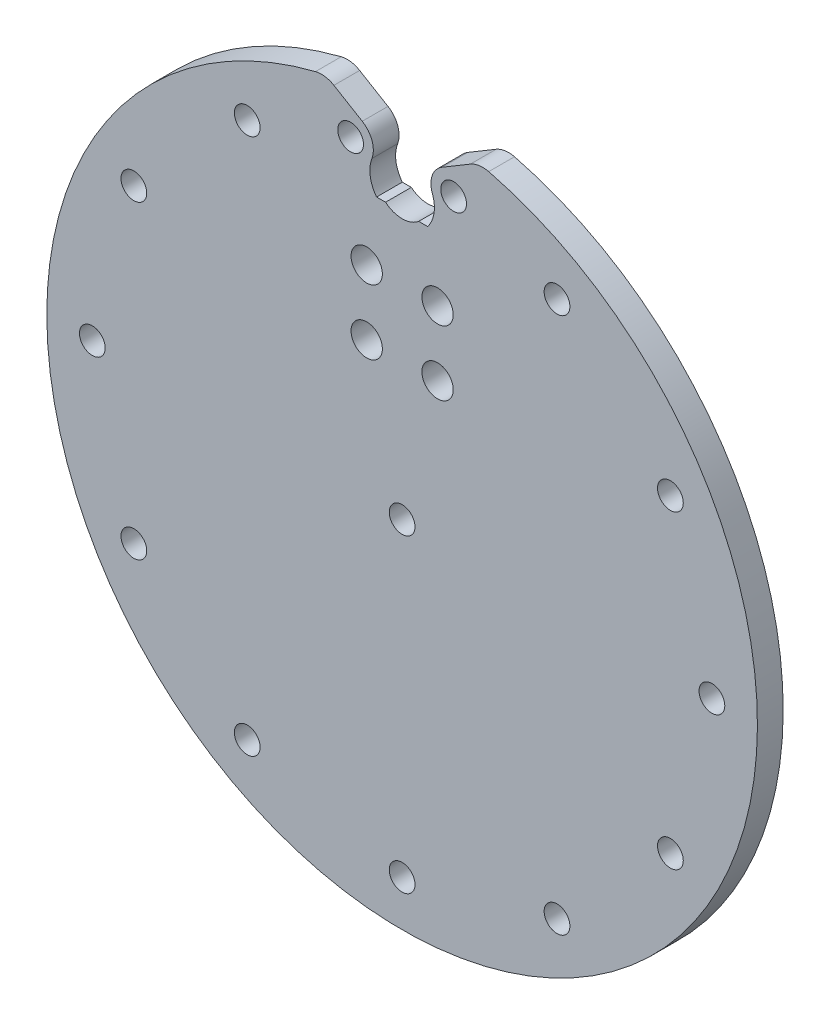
ISO-10303-21;
HEADER;
FILE_DESCRIPTION(('STEP AP214'),'2;1');
FILE_NAME('part.step','',(''),(''),'','','');
FILE_SCHEMA(('AUTOMOTIVE_DESIGN { 1 0 10303 214 1 1 1 1 }'));
ENDSEC;
DATA;
#1=APPLICATION_CONTEXT('core data for automotive mechanical design processes');
#2=APPLICATION_PROTOCOL_DEFINITION('international standard','automotive_design',2000,#1);
#3=PRODUCT_CONTEXT('',#1,'mechanical');
#4=PRODUCT('Part','Part','',(#3));
#5=PRODUCT_RELATED_PRODUCT_CATEGORY('part','',(#4));
#6=PRODUCT_DEFINITION_FORMATION('','',#4);
#7=PRODUCT_DEFINITION_CONTEXT('part definition',#1,'design');
#8=PRODUCT_DEFINITION('design','',#6,#7);
#9=PRODUCT_DEFINITION_SHAPE('','',#8);
#10=(LENGTH_UNIT() NAMED_UNIT(*) SI_UNIT(.MILLI.,.METRE.));
#11=(NAMED_UNIT(*) PLANE_ANGLE_UNIT() SI_UNIT($,.RADIAN.));
#12=(NAMED_UNIT(*) SI_UNIT($,.STERADIAN.) SOLID_ANGLE_UNIT());
#13=UNCERTAINTY_MEASURE_WITH_UNIT(LENGTH_MEASURE(1.E-05),#10,'distance_accuracy_value','');
#14=(GEOMETRIC_REPRESENTATION_CONTEXT(3) GLOBAL_UNCERTAINTY_ASSIGNED_CONTEXT((#13)) GLOBAL_UNIT_ASSIGNED_CONTEXT((#10,
#11,#12)) REPRESENTATION_CONTEXT('',''));
#15=CARTESIAN_POINT('',(0.,0.,0.));
#16=DIRECTION('',(0.,0.,1.));
#17=DIRECTION('',(1.,0.,0.));
#18=AXIS2_PLACEMENT_3D('',#15,#16,#17);
#19=CARTESIAN_POINT('',(0.,0.,3.175));
#20=DIRECTION('',(0.,0.,1.));
#21=DIRECTION('',(1.,0.,0.));
#22=AXIS2_PLACEMENT_3D('',#19,#20,#21);
#23=PLANE('',#22);
#24=CARTESIAN_POINT('',(6.35,37.6685213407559,3.175));
#25=DIRECTION('',(0.,0.,1.));
#26=DIRECTION('',(1.,0.,0.));
#27=AXIS2_PLACEMENT_3D('',#24,#25,#26);
#28=CIRCLE('',#27,1.5875000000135);
#29=CARTESIAN_POINT('',(7.9375000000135,37.6685213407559,3.175));
#30=VERTEX_POINT('',#29);
#31=EDGE_CURVE('E564',#30,#30,#28,.T.);
#32=ORIENTED_EDGE('',*,*,#31,.F.);
#33=EDGE_LOOP('',(#32));
#34=FACE_BOUND('',#33,.T.);
#35=CARTESIAN_POINT('',(4.36880000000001,25.,3.175));
#36=DIRECTION('',(0.,0.,1.));
#37=DIRECTION('',(1.,0.,0.));
#38=AXIS2_PLACEMENT_3D('',#35,#36,#37);
#39=CIRCLE('',#38,1.9304);
#40=CARTESIAN_POINT('',(6.29920000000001,25.,3.175));
#41=VERTEX_POINT('',#40);
#42=EDGE_CURVE('E576',#41,#41,#39,.T.);
#43=ORIENTED_EDGE('',*,*,#42,.F.);
#44=EDGE_LOOP('',(#43));
#45=FACE_BOUND('',#44,.T.);
#46=CARTESIAN_POINT('',(-4.36880000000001,17.,3.175));
#47=DIRECTION('',(0.,0.,1.));
#48=DIRECTION('',(1.,0.,0.));
#49=AXIS2_PLACEMENT_3D('',#46,#47,#48);
#50=CIRCLE('',#49,1.9304);
#51=CARTESIAN_POINT('',(-2.43840000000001,17.,3.175));
#52=VERTEX_POINT('',#51);
#53=EDGE_CURVE('E588',#52,#52,#50,.T.);
#54=ORIENTED_EDGE('',*,*,#53,.F.);
#55=EDGE_LOOP('',(#54));
#56=FACE_BOUND('',#55,.T.);
#57=CARTESIAN_POINT('',(19.0999999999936,33.0821704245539,3.175));
#58=DIRECTION('',(0.,0.,1.));
#59=DIRECTION('',(1.,0.,0.));
#60=AXIS2_PLACEMENT_3D('',#57,#58,#59);
#61=CIRCLE('',#60,1.58750000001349);
#62=CARTESIAN_POINT('',(20.6875000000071,33.0821704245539,3.175));
#63=VERTEX_POINT('',#62);
#64=EDGE_CURVE('E600',#63,#63,#61,.T.);
#65=ORIENTED_EDGE('',*,*,#64,.F.);
#66=EDGE_LOOP('',(#65));
#67=FACE_BOUND('',#66,.T.);
#68=CARTESIAN_POINT('',(-19.0999999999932,33.0821704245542,3.175));
#69=DIRECTION('',(0.,0.,1.));
#70=DIRECTION('',(1.,0.,0.));
#71=AXIS2_PLACEMENT_3D('',#68,#69,#70);
#72=CIRCLE('',#71,1.5875000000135);
#73=CARTESIAN_POINT('',(-17.5124999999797,33.0821704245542,3.175));
#74=VERTEX_POINT('',#73);
#75=EDGE_CURVE('E612',#74,#74,#72,.T.);
#76=ORIENTED_EDGE('',*,*,#75,.F.);
#77=EDGE_LOOP('',(#76));
#78=FACE_BOUND('',#77,.T.);
#79=CARTESIAN_POINT('',(-38.1999999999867,1.33374587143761E-13,3.175));
#80=DIRECTION('',(0.,0.,1.));
#81=DIRECTION('',(1.,0.,0.));
#82=AXIS2_PLACEMENT_3D('',#79,#80,#81);
#83=CIRCLE('',#82,1.58750000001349);
#84=CARTESIAN_POINT('',(-36.6124999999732,1.33374587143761E-13,3.175));
#85=VERTEX_POINT('',#84);
#86=EDGE_CURVE('E624',#85,#85,#83,.T.);
#87=ORIENTED_EDGE('',*,*,#86,.F.);
#88=EDGE_LOOP('',(#87));
#89=FACE_BOUND('',#88,.T.);
#90=CARTESIAN_POINT('',(33.0821704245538,-19.0999999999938,3.175));
#91=DIRECTION('',(0.,0.,1.));
#92=DIRECTION('',(1.,0.,0.));
#93=AXIS2_PLACEMENT_3D('',#90,#91,#92);
#94=CIRCLE('',#93,1.58750000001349);
#95=CARTESIAN_POINT('',(34.6696704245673,-19.0999999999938,3.175));
#96=VERTEX_POINT('',#95);
#97=EDGE_CURVE('E636',#96,#96,#94,.T.);
#98=ORIENTED_EDGE('',*,*,#97,.F.);
#99=EDGE_LOOP('',(#98));
#100=FACE_BOUND('',#99,.T.);
#101=CARTESIAN_POINT('',(0.,-38.1999999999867,3.175));
#102=DIRECTION('',(0.,0.,1.));
#103=DIRECTION('',(1.,0.,0.));
#104=AXIS2_PLACEMENT_3D('',#101,#102,#103);
#105=CIRCLE('',#104,1.58750000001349);
#106=CARTESIAN_POINT('',(1.58750000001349,-38.1999999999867,3.175));
#107=VERTEX_POINT('',#106);
#108=EDGE_CURVE('E648',#107,#107,#105,.T.);
#109=ORIENTED_EDGE('',*,*,#108,.F.);
#110=EDGE_LOOP('',(#109));
#111=FACE_BOUND('',#110,.T.);
#112=CARTESIAN_POINT('',(-33.0821704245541,-19.0999999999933,3.175));
#113=DIRECTION('',(0.,0.,1.));
#114=DIRECTION('',(1.,0.,0.));
#115=AXIS2_PLACEMENT_3D('',#112,#113,#114);
#116=CIRCLE('',#115,1.58750000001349);
#117=CARTESIAN_POINT('',(-31.4946704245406,-19.0999999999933,3.175));
#118=VERTEX_POINT('',#117);
#119=EDGE_CURVE('E172',#118,#118,#116,.T.);
#120=ORIENTED_EDGE('',*,*,#119,.F.);
#121=EDGE_LOOP('',(#120));
#122=FACE_BOUND('',#121,.T.);
#123=CARTESIAN_POINT('',(0.,0.,3.175));
#124=DIRECTION('',(0.,0.,1.));
#125=DIRECTION('',(1.,0.,0.));
#126=AXIS2_PLACEMENT_3D('',#123,#124,#125);
#127=CIRCLE('',#126,43.815);
#128=CARTESIAN_POINT('',(-10.6819342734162,42.4929465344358,3.175));
#129=VERTEX_POINT('',#128);
#130=CARTESIAN_POINT('',(10.6819342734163,42.4929465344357,3.175));
#131=VERTEX_POINT('',#130);
#132=EDGE_CURVE('E137',#129,#131,#127,.T.);
#133=ORIENTED_EDGE('',*,*,#132,.T.);
#134=CARTESIAN_POINT('',(9.95054541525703,39.5834671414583,3.175));
#135=DIRECTION('',(0.,0.,1.));
#136=DIRECTION('',(1.,0.,0.));
#137=AXIS2_PLACEMENT_3D('',#134,#135,#136);
#138=CIRCLE('',#137,3.);
#139=CARTESIAN_POINT('',(8.41363997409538,42.1598835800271,3.175));
#140=VERTEX_POINT('',#139);
#141=EDGE_CURVE('E45',#131,#140,#138,.T.);
#142=ORIENTED_EDGE('',*,*,#141,.T.);
#143=DIRECTION('',(-0.858805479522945,-0.512301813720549,0.));
#144=VECTOR('',#143,1.);
#145=CARTESIAN_POINT('',(4.91555492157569,40.0731766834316,3.175));
#146=LINE('',#145,#144);
#147=CARTESIAN_POINT('',(4.91555492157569,40.0731766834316,3.175));
#148=VERTEX_POINT('',#147);
#149=EDGE_CURVE('E127',#140,#148,#146,.T.);
#150=ORIENTED_EDGE('',*,*,#149,.T.);
#151=CARTESIAN_POINT('',(6.35,37.6685213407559,3.175));
#152=DIRECTION('',(0.,0.,1.));
#153=DIRECTION('',(1.,0.,0.));
#154=AXIS2_PLACEMENT_3D('',#151,#152,#153);
#155=CIRCLE('',#154,2.80000000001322);
#156=CARTESIAN_POINT('',(3.72758112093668,36.6872368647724,3.175));
#157=VERTEX_POINT('',#156);
#158=EDGE_CURVE('E131',#148,#157,#155,.T.);
#159=ORIENTED_EDGE('',*,*,#158,.T.);
#160=CARTESIAN_POINT('',(0.,35.2924110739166,3.175));
#161=DIRECTION('',(0.,0.,-1.));
#162=DIRECTION('',(1.,0.,0.));
#163=AXIS2_PLACEMENT_3D('',#160,#161,#162);
#164=CIRCLE('',#163,3.98);
#165=CARTESIAN_POINT('',(3.15206281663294,32.8624110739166,3.175));
#166=VERTEX_POINT('',#165);
#167=EDGE_CURVE('E152',#157,#166,#164,.T.);
#168=ORIENTED_EDGE('',*,*,#167,.T.);
#169=DIRECTION('',(-1.,0.,0.));
#170=VECTOR('',#169,1.);
#171=CARTESIAN_POINT('',(2.04345907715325,32.8624110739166,3.175));
#172=LINE('',#171,#170);
#173=CARTESIAN_POINT('',(2.04345907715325,32.8624110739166,3.175));
#174=VERTEX_POINT('',#173);
#175=EDGE_CURVE('E154',#166,#174,#172,.T.);
#176=ORIENTED_EDGE('',*,*,#175,.T.);
#177=CARTESIAN_POINT('',(0.,35.2924110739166,3.175));
#178=DIRECTION('',(0.,0.,-1.));
#179=DIRECTION('',(1.,0.,0.));
#180=AXIS2_PLACEMENT_3D('',#177,#178,#179);
#181=CIRCLE('',#180,3.175);
#182=CARTESIAN_POINT('',(-2.04345907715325,32.8624110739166,3.175));
#183=VERTEX_POINT('',#182);
#184=EDGE_CURVE('E159',#174,#183,#181,.T.);
#185=ORIENTED_EDGE('',*,*,#184,.T.);
#186=DIRECTION('',(-1.,0.,0.));
#187=VECTOR('',#186,1.);
#188=CARTESIAN_POINT('',(-2.04345907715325,32.8624110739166,3.175));
#189=LINE('',#188,#187);
#190=CARTESIAN_POINT('',(-3.15206281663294,32.8624110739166,3.175));
#191=VERTEX_POINT('',#190);
#192=EDGE_CURVE('E161',#183,#191,#189,.T.);
#193=ORIENTED_EDGE('',*,*,#192,.T.);
#194=CARTESIAN_POINT('',(0.,35.2924110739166,3.175));
#195=DIRECTION('',(0.,0.,-1.));
#196=DIRECTION('',(1.,0.,0.));
#197=AXIS2_PLACEMENT_3D('',#194,#195,#196);
#198=CIRCLE('',#197,3.98);
#199=CARTESIAN_POINT('',(-3.72758112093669,36.6872368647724,3.175));
#200=VERTEX_POINT('',#199);
#201=EDGE_CURVE('E163',#191,#200,#198,.T.);
#202=ORIENTED_EDGE('',*,*,#201,.T.);
#203=CARTESIAN_POINT('',(-6.35000000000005,37.6685213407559,3.175));
#204=DIRECTION('',(0.,0.,1.));
#205=DIRECTION('',(1.,0.,0.));
#206=AXIS2_PLACEMENT_3D('',#203,#204,#205);
#207=CIRCLE('',#206,2.80000000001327);
#208=CARTESIAN_POINT('',(-4.91555492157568,40.0731766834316,3.175));
#209=VERTEX_POINT('',#208);
#210=EDGE_CURVE('E165',#200,#209,#207,.T.);
#211=ORIENTED_EDGE('',*,*,#210,.T.);
#212=DIRECTION('',(-0.858805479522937,0.512301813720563,0.));
#213=VECTOR('',#212,1.);
#214=CARTESIAN_POINT('',(-4.91555492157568,40.0731766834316,3.175));
#215=LINE('',#214,#213);
#216=CARTESIAN_POINT('',(-8.41363997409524,42.1598835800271,3.175));
#217=VERTEX_POINT('',#216);
#218=EDGE_CURVE('E167',#209,#217,#215,.T.);
#219=ORIENTED_EDGE('',*,*,#218,.T.);
#220=CARTESIAN_POINT('',(-9.95054541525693,39.5834671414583,3.175));
#221=DIRECTION('',(0.,0.,1.));
#222=DIRECTION('',(1.,0.,0.));
#223=AXIS2_PLACEMENT_3D('',#220,#221,#222);
#224=CIRCLE('',#223,3.);
#225=EDGE_CURVE('E217',#217,#129,#224,.T.);
#226=ORIENTED_EDGE('',*,*,#225,.T.);
#227=EDGE_LOOP('',(#133,#142,#150,#159,#168,#176,#185,#193,#202,#211,#219,#226));
#228=FACE_BOUND('',#227,.T.);
#229=CARTESIAN_POINT('',(-19.0999999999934,-33.082170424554,3.175));
#230=DIRECTION('',(0.,0.,1.));
#231=DIRECTION('',(1.,0.,0.));
#232=AXIS2_PLACEMENT_3D('',#229,#230,#231);
#233=CIRCLE('',#232,1.58750000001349);
#234=CARTESIAN_POINT('',(-17.5124999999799,-33.082170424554,3.175));
#235=VERTEX_POINT('',#234);
#236=EDGE_CURVE('E654',#235,#235,#233,.T.);
#237=ORIENTED_EDGE('',*,*,#236,.F.);
#238=EDGE_LOOP('',(#237));
#239=FACE_BOUND('',#238,.T.);
#240=CARTESIAN_POINT('',(19.0999999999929,-33.0821704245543,3.175));
#241=DIRECTION('',(0.,0.,1.));
#242=DIRECTION('',(1.,0.,0.));
#243=AXIS2_PLACEMENT_3D('',#240,#241,#242);
#244=CIRCLE('',#243,1.58750000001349);
#245=CARTESIAN_POINT('',(20.6875000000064,-33.0821704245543,3.175));
#246=VERTEX_POINT('',#245);
#247=EDGE_CURVE('E642',#246,#246,#244,.T.);
#248=ORIENTED_EDGE('',*,*,#247,.F.);
#249=EDGE_LOOP('',(#248));
#250=FACE_BOUND('',#249,.T.);
#251=CARTESIAN_POINT('',(38.1999999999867,-4.00123761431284E-13,3.175));
#252=DIRECTION('',(0.,0.,1.));
#253=DIRECTION('',(1.,0.,0.));
#254=AXIS2_PLACEMENT_3D('',#251,#252,#253);
#255=CIRCLE('',#254,1.58750000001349);
#256=CARTESIAN_POINT('',(39.7875000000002,-4.00123761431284E-13,3.175));
#257=VERTEX_POINT('',#256);
#258=EDGE_CURVE('E630',#257,#257,#255,.T.);
#259=ORIENTED_EDGE('',*,*,#258,.F.);
#260=EDGE_LOOP('',(#259));
#261=FACE_BOUND('',#260,.T.);
#262=CARTESIAN_POINT('',(-33.082170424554,19.0999999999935,3.175));
#263=DIRECTION('',(0.,0.,1.));
#264=DIRECTION('',(1.,0.,0.));
#265=AXIS2_PLACEMENT_3D('',#262,#263,#264);
#266=CIRCLE('',#265,1.58750000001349);
#267=CARTESIAN_POINT('',(-31.4946704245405,19.0999999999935,3.175));
#268=VERTEX_POINT('',#267);
#269=EDGE_CURVE('E618',#268,#268,#266,.T.);
#270=ORIENTED_EDGE('',*,*,#269,.F.);
#271=EDGE_LOOP('',(#270));
#272=FACE_BOUND('',#271,.T.);
#273=CARTESIAN_POINT('',(33.0821704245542,19.0999999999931,3.175));
#274=DIRECTION('',(0.,0.,1.));
#275=DIRECTION('',(1.,0.,0.));
#276=AXIS2_PLACEMENT_3D('',#273,#274,#275);
#277=CIRCLE('',#276,1.5875000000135);
#278=CARTESIAN_POINT('',(34.6696704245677,19.0999999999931,3.175));
#279=VERTEX_POINT('',#278);
#280=EDGE_CURVE('E606',#279,#279,#277,.T.);
#281=ORIENTED_EDGE('',*,*,#280,.F.);
#282=EDGE_LOOP('',(#281));
#283=FACE_BOUND('',#282,.T.);
#284=CARTESIAN_POINT('',(-6.35000000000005,37.6685213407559,3.175));
#285=DIRECTION('',(0.,0.,1.));
#286=DIRECTION('',(1.,0.,0.));
#287=AXIS2_PLACEMENT_3D('',#284,#285,#286);
#288=CIRCLE('',#287,1.58750000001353);
#289=CARTESIAN_POINT('',(-4.76249999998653,37.6685213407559,3.175));
#290=VERTEX_POINT('',#289);
#291=EDGE_CURVE('E594',#290,#290,#288,.T.);
#292=ORIENTED_EDGE('',*,*,#291,.F.);
#293=EDGE_LOOP('',(#292));
#294=FACE_BOUND('',#293,.T.);
#295=CARTESIAN_POINT('',(-4.36880000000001,25.,3.175));
#296=DIRECTION('',(0.,0.,1.));
#297=DIRECTION('',(1.,0.,0.));
#298=AXIS2_PLACEMENT_3D('',#295,#296,#297);
#299=CIRCLE('',#298,1.9304);
#300=CARTESIAN_POINT('',(-2.43840000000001,25.,3.175));
#301=VERTEX_POINT('',#300);
#302=EDGE_CURVE('E582',#301,#301,#299,.T.);
#303=ORIENTED_EDGE('',*,*,#302,.F.);
#304=EDGE_LOOP('',(#303));
#305=FACE_BOUND('',#304,.T.);
#306=CARTESIAN_POINT('',(4.36880000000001,17.,3.175));
#307=DIRECTION('',(0.,0.,1.));
#308=DIRECTION('',(1.,0.,0.));
#309=AXIS2_PLACEMENT_3D('',#306,#307,#308);
#310=CIRCLE('',#309,1.9304);
#311=CARTESIAN_POINT('',(6.29920000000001,17.,3.175));
#312=VERTEX_POINT('',#311);
#313=EDGE_CURVE('E570',#312,#312,#310,.T.);
#314=ORIENTED_EDGE('',*,*,#313,.F.);
#315=EDGE_LOOP('',(#314));
#316=FACE_BOUND('',#315,.T.);
#317=CARTESIAN_POINT('',(0.,0.,3.175));
#318=DIRECTION('',(0.,0.,1.));
#319=DIRECTION('',(1.,0.,0.));
#320=AXIS2_PLACEMENT_3D('',#317,#318,#319);
#321=CIRCLE('',#320,1.5875);
#322=CARTESIAN_POINT('',(1.5875,0.,3.175));
#323=VERTEX_POINT('',#322);
#324=EDGE_CURVE('E555',#323,#323,#321,.T.);
#325=ORIENTED_EDGE('',*,*,#324,.F.);
#326=EDGE_LOOP('',(#325));
#327=FACE_BOUND('',#326,.T.);
#328=ADVANCED_FACE('F37',(#34,#45,#56,#67,#78,#89,#100,#111,#122,#228,#239,#250,#261,#272,#283,
#294,#305,#316,#327),#23,.T.);
#329=CARTESIAN_POINT('',(0.,0.,0.));
#330=DIRECTION('',(0.,0.,1.));
#331=DIRECTION('',(1.,0.,0.));
#332=AXIS2_PLACEMENT_3D('',#329,#330,#331);
#333=PLANE('',#332);
#334=DIRECTION('',(-0.858805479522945,-0.512301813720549,0.));
#335=VECTOR('',#334,1.);
#336=CARTESIAN_POINT('',(4.91555492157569,40.0731766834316,0.));
#337=LINE('',#336,#335);
#338=CARTESIAN_POINT('',(8.41363997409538,42.1598835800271,0.));
#339=VERTEX_POINT('',#338);
#340=CARTESIAN_POINT('',(4.91555492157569,40.0731766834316,0.));
#341=VERTEX_POINT('',#340);
#342=EDGE_CURVE('E143',#339,#341,#337,.T.);
#343=ORIENTED_EDGE('',*,*,#342,.F.);
#344=CARTESIAN_POINT('',(9.95054541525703,39.5834671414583,0.));
#345=DIRECTION('',(0.,0.,1.));
#346=DIRECTION('',(1.,0.,0.));
#347=AXIS2_PLACEMENT_3D('',#344,#345,#346);
#348=CIRCLE('',#347,3.);
#349=CARTESIAN_POINT('',(10.6819342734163,42.4929465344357,0.));
#350=VERTEX_POINT('',#349);
#351=EDGE_CURVE('E211',#339,#350,#348,.F.);
#352=ORIENTED_EDGE('',*,*,#351,.T.);
#353=CARTESIAN_POINT('',(0.,0.,0.));
#354=DIRECTION('',(0.,0.,1.));
#355=DIRECTION('',(1.,0.,0.));
#356=AXIS2_PLACEMENT_3D('',#353,#354,#355);
#357=CIRCLE('',#356,43.815);
#358=CARTESIAN_POINT('',(-10.6819342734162,42.4929465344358,0.));
#359=VERTEX_POINT('',#358);
#360=EDGE_CURVE('E170',#359,#350,#357,.T.);
#361=ORIENTED_EDGE('',*,*,#360,.F.);
#362=CARTESIAN_POINT('',(-9.95054541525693,39.5834671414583,0.));
#363=DIRECTION('',(0.,0.,1.));
#364=DIRECTION('',(1.,0.,0.));
#365=AXIS2_PLACEMENT_3D('',#362,#363,#364);
#366=CIRCLE('',#365,3.);
#367=CARTESIAN_POINT('',(-8.41363997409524,42.1598835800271,0.));
#368=VERTEX_POINT('',#367);
#369=EDGE_CURVE('E209',#359,#368,#366,.F.);
#370=ORIENTED_EDGE('',*,*,#369,.T.);
#371=DIRECTION('',(-0.858805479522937,0.512301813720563,0.));
#372=VECTOR('',#371,1.);
#373=CARTESIAN_POINT('',(-4.91555492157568,40.0731766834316,0.));
#374=LINE('',#373,#372);
#375=CARTESIAN_POINT('',(-4.91555492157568,40.0731766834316,0.));
#376=VERTEX_POINT('',#375);
#377=EDGE_CURVE('E188',#376,#368,#374,.T.);
#378=ORIENTED_EDGE('',*,*,#377,.F.);
#379=CARTESIAN_POINT('',(-6.35000000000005,37.6685213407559,0.));
#380=DIRECTION('',(0.,0.,1.));
#381=DIRECTION('',(1.,0.,0.));
#382=AXIS2_PLACEMENT_3D('',#379,#380,#381);
#383=CIRCLE('',#382,2.80000000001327);
#384=CARTESIAN_POINT('',(-3.72758112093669,36.6872368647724,0.));
#385=VERTEX_POINT('',#384);
#386=EDGE_CURVE('E186',#385,#376,#383,.T.);
#387=ORIENTED_EDGE('',*,*,#386,.F.);
#388=CARTESIAN_POINT('',(0.,35.2924110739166,0.));
#389=DIRECTION('',(0.,0.,-1.));
#390=DIRECTION('',(1.,0.,0.));
#391=AXIS2_PLACEMENT_3D('',#388,#389,#390);
#392=CIRCLE('',#391,3.98);
#393=CARTESIAN_POINT('',(-3.15206281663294,32.8624110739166,0.));
#394=VERTEX_POINT('',#393);
#395=EDGE_CURVE('E184',#394,#385,#392,.T.);
#396=ORIENTED_EDGE('',*,*,#395,.F.);
#397=DIRECTION('',(-1.,0.,0.));
#398=VECTOR('',#397,1.);
#399=CARTESIAN_POINT('',(-2.04345907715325,32.8624110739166,0.));
#400=LINE('',#399,#398);
#401=CARTESIAN_POINT('',(-2.04345907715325,32.8624110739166,0.));
#402=VERTEX_POINT('',#401);
#403=EDGE_CURVE('E182',#402,#394,#400,.T.);
#404=ORIENTED_EDGE('',*,*,#403,.F.);
#405=CARTESIAN_POINT('',(0.,35.2924110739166,0.));
#406=DIRECTION('',(0.,0.,-1.));
#407=DIRECTION('',(1.,0.,0.));
#408=AXIS2_PLACEMENT_3D('',#405,#406,#407);
#409=CIRCLE('',#408,3.175);
#410=CARTESIAN_POINT('',(2.04345907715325,32.8624110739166,0.));
#411=VERTEX_POINT('',#410);
#412=EDGE_CURVE('E180',#411,#402,#409,.T.);
#413=ORIENTED_EDGE('',*,*,#412,.F.);
#414=DIRECTION('',(-1.,0.,0.));
#415=VECTOR('',#414,1.);
#416=CARTESIAN_POINT('',(2.04345907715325,32.8624110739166,0.));
#417=LINE('',#416,#415);
#418=CARTESIAN_POINT('',(3.15206281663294,32.8624110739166,0.));
#419=VERTEX_POINT('',#418);
#420=EDGE_CURVE('E178',#419,#411,#417,.T.);
#421=ORIENTED_EDGE('',*,*,#420,.F.);
#422=CARTESIAN_POINT('',(0.,35.2924110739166,0.));
#423=DIRECTION('',(0.,0.,-1.));
#424=DIRECTION('',(1.,0.,0.));
#425=AXIS2_PLACEMENT_3D('',#422,#423,#424);
#426=CIRCLE('',#425,3.98);
#427=CARTESIAN_POINT('',(3.72758112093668,36.6872368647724,0.));
#428=VERTEX_POINT('',#427);
#429=EDGE_CURVE('E176',#428,#419,#426,.T.);
#430=ORIENTED_EDGE('',*,*,#429,.F.);
#431=CARTESIAN_POINT('',(6.35,37.6685213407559,0.));
#432=DIRECTION('',(0.,0.,1.));
#433=DIRECTION('',(1.,0.,0.));
#434=AXIS2_PLACEMENT_3D('',#431,#432,#433);
#435=CIRCLE('',#434,2.80000000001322);
#436=EDGE_CURVE('E174',#341,#428,#435,.T.);
#437=ORIENTED_EDGE('',*,*,#436,.F.);
#438=EDGE_LOOP('',(#343,#352,#361,#370,#378,#387,#396,#404,#413,#421,#430,#437));
#439=FACE_BOUND('',#438,.T.);
#440=CARTESIAN_POINT('',(-33.0821704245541,-19.0999999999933,0.));
#441=DIRECTION('',(0.,0.,1.));
#442=DIRECTION('',(1.,0.,0.));
#443=AXIS2_PLACEMENT_3D('',#440,#441,#442);
#444=CIRCLE('',#443,1.58750000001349);
#445=CARTESIAN_POINT('',(-31.4946704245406,-19.0999999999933,0.));
#446=VERTEX_POINT('',#445);
#447=EDGE_CURVE('E657',#446,#446,#444,.T.);
#448=ORIENTED_EDGE('',*,*,#447,.T.);
#449=EDGE_LOOP('',(#448));
#450=FACE_BOUND('',#449,.T.);
#451=CARTESIAN_POINT('',(-19.0999999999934,-33.082170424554,0.));
#452=DIRECTION('',(0.,0.,1.));
#453=DIRECTION('',(1.,0.,0.));
#454=AXIS2_PLACEMENT_3D('',#451,#452,#453);
#455=CIRCLE('',#454,1.58750000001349);
#456=CARTESIAN_POINT('',(-17.5124999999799,-33.082170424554,0.));
#457=VERTEX_POINT('',#456);
#458=EDGE_CURVE('E651',#457,#457,#455,.T.);
#459=ORIENTED_EDGE('',*,*,#458,.T.);
#460=EDGE_LOOP('',(#459));
#461=FACE_BOUND('',#460,.T.);
#462=CARTESIAN_POINT('',(0.,-38.1999999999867,0.));
#463=DIRECTION('',(0.,0.,1.));
#464=DIRECTION('',(1.,0.,0.));
#465=AXIS2_PLACEMENT_3D('',#462,#463,#464);
#466=CIRCLE('',#465,1.58750000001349);
#467=CARTESIAN_POINT('',(1.58750000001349,-38.1999999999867,0.));
#468=VERTEX_POINT('',#467);
#469=EDGE_CURVE('E645',#468,#468,#466,.T.);
#470=ORIENTED_EDGE('',*,*,#469,.T.);
#471=EDGE_LOOP('',(#470));
#472=FACE_BOUND('',#471,.T.);
#473=CARTESIAN_POINT('',(19.0999999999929,-33.0821704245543,0.));
#474=DIRECTION('',(0.,0.,1.));
#475=DIRECTION('',(1.,0.,0.));
#476=AXIS2_PLACEMENT_3D('',#473,#474,#475);
#477=CIRCLE('',#476,1.58750000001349);
#478=CARTESIAN_POINT('',(20.6875000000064,-33.0821704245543,0.));
#479=VERTEX_POINT('',#478);
#480=EDGE_CURVE('E639',#479,#479,#477,.T.);
#481=ORIENTED_EDGE('',*,*,#480,.T.);
#482=EDGE_LOOP('',(#481));
#483=FACE_BOUND('',#482,.T.);
#484=CARTESIAN_POINT('',(33.0821704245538,-19.0999999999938,0.));
#485=DIRECTION('',(0.,0.,1.));
#486=DIRECTION('',(1.,0.,0.));
#487=AXIS2_PLACEMENT_3D('',#484,#485,#486);
#488=CIRCLE('',#487,1.58750000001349);
#489=CARTESIAN_POINT('',(34.6696704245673,-19.0999999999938,0.));
#490=VERTEX_POINT('',#489);
#491=EDGE_CURVE('E633',#490,#490,#488,.T.);
#492=ORIENTED_EDGE('',*,*,#491,.T.);
#493=EDGE_LOOP('',(#492));
#494=FACE_BOUND('',#493,.T.);
#495=CARTESIAN_POINT('',(38.1999999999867,-4.00123761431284E-13,0.));
#496=DIRECTION('',(0.,0.,1.));
#497=DIRECTION('',(1.,0.,0.));
#498=AXIS2_PLACEMENT_3D('',#495,#496,#497);
#499=CIRCLE('',#498,1.58750000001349);
#500=CARTESIAN_POINT('',(39.7875000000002,-4.00123761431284E-13,0.));
#501=VERTEX_POINT('',#500);
#502=EDGE_CURVE('E627',#501,#501,#499,.T.);
#503=ORIENTED_EDGE('',*,*,#502,.T.);
#504=EDGE_LOOP('',(#503));
#505=FACE_BOUND('',#504,.T.);
#506=CARTESIAN_POINT('',(-38.1999999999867,1.33374587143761E-13,0.));
#507=DIRECTION('',(0.,0.,1.));
#508=DIRECTION('',(1.,0.,0.));
#509=AXIS2_PLACEMENT_3D('',#506,#507,#508);
#510=CIRCLE('',#509,1.58750000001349);
#511=CARTESIAN_POINT('',(-36.6124999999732,1.33374587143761E-13,0.));
#512=VERTEX_POINT('',#511);
#513=EDGE_CURVE('E621',#512,#512,#510,.T.);
#514=ORIENTED_EDGE('',*,*,#513,.T.);
#515=EDGE_LOOP('',(#514));
#516=FACE_BOUND('',#515,.T.);
#517=CARTESIAN_POINT('',(-33.082170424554,19.0999999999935,0.));
#518=DIRECTION('',(0.,0.,1.));
#519=DIRECTION('',(1.,0.,0.));
#520=AXIS2_PLACEMENT_3D('',#517,#518,#519);
#521=CIRCLE('',#520,1.58750000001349);
#522=CARTESIAN_POINT('',(-31.4946704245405,19.0999999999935,0.));
#523=VERTEX_POINT('',#522);
#524=EDGE_CURVE('E615',#523,#523,#521,.T.);
#525=ORIENTED_EDGE('',*,*,#524,.T.);
#526=EDGE_LOOP('',(#525));
#527=FACE_BOUND('',#526,.T.);
#528=CARTESIAN_POINT('',(-19.0999999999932,33.0821704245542,0.));
#529=DIRECTION('',(0.,0.,1.));
#530=DIRECTION('',(1.,0.,0.));
#531=AXIS2_PLACEMENT_3D('',#528,#529,#530);
#532=CIRCLE('',#531,1.5875000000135);
#533=CARTESIAN_POINT('',(-17.5124999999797,33.0821704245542,0.));
#534=VERTEX_POINT('',#533);
#535=EDGE_CURVE('E609',#534,#534,#532,.T.);
#536=ORIENTED_EDGE('',*,*,#535,.T.);
#537=EDGE_LOOP('',(#536));
#538=FACE_BOUND('',#537,.T.);
#539=CARTESIAN_POINT('',(33.0821704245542,19.0999999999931,0.));
#540=DIRECTION('',(0.,0.,1.));
#541=DIRECTION('',(1.,0.,0.));
#542=AXIS2_PLACEMENT_3D('',#539,#540,#541);
#543=CIRCLE('',#542,1.5875000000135);
#544=CARTESIAN_POINT('',(34.6696704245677,19.0999999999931,0.));
#545=VERTEX_POINT('',#544);
#546=EDGE_CURVE('E603',#545,#545,#543,.T.);
#547=ORIENTED_EDGE('',*,*,#546,.T.);
#548=EDGE_LOOP('',(#547));
#549=FACE_BOUND('',#548,.T.);
#550=CARTESIAN_POINT('',(19.0999999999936,33.0821704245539,0.));
#551=DIRECTION('',(0.,0.,1.));
#552=DIRECTION('',(1.,0.,0.));
#553=AXIS2_PLACEMENT_3D('',#550,#551,#552);
#554=CIRCLE('',#553,1.58750000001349);
#555=CARTESIAN_POINT('',(20.6875000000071,33.0821704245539,0.));
#556=VERTEX_POINT('',#555);
#557=EDGE_CURVE('E597',#556,#556,#554,.T.);
#558=ORIENTED_EDGE('',*,*,#557,.T.);
#559=EDGE_LOOP('',(#558));
#560=FACE_BOUND('',#559,.T.);
#561=CARTESIAN_POINT('',(-6.35000000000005,37.6685213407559,0.));
#562=DIRECTION('',(0.,0.,1.));
#563=DIRECTION('',(1.,0.,0.));
#564=AXIS2_PLACEMENT_3D('',#561,#562,#563);
#565=CIRCLE('',#564,1.58750000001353);
#566=CARTESIAN_POINT('',(-4.76249999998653,37.6685213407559,0.));
#567=VERTEX_POINT('',#566);
#568=EDGE_CURVE('E591',#567,#567,#565,.T.);
#569=ORIENTED_EDGE('',*,*,#568,.T.);
#570=EDGE_LOOP('',(#569));
#571=FACE_BOUND('',#570,.T.);
#572=CARTESIAN_POINT('',(-4.36880000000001,17.,0.));
#573=DIRECTION('',(0.,0.,1.));
#574=DIRECTION('',(1.,0.,0.));
#575=AXIS2_PLACEMENT_3D('',#572,#573,#574);
#576=CIRCLE('',#575,1.9304);
#577=CARTESIAN_POINT('',(-2.43840000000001,17.,0.));
#578=VERTEX_POINT('',#577);
#579=EDGE_CURVE('E585',#578,#578,#576,.T.);
#580=ORIENTED_EDGE('',*,*,#579,.T.);
#581=EDGE_LOOP('',(#580));
#582=FACE_BOUND('',#581,.T.);
#583=CARTESIAN_POINT('',(-4.36880000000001,25.,0.));
#584=DIRECTION('',(0.,0.,1.));
#585=DIRECTION('',(1.,0.,0.));
#586=AXIS2_PLACEMENT_3D('',#583,#584,#585);
#587=CIRCLE('',#586,1.9304);
#588=CARTESIAN_POINT('',(-2.43840000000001,25.,0.));
#589=VERTEX_POINT('',#588);
#590=EDGE_CURVE('E579',#589,#589,#587,.T.);
#591=ORIENTED_EDGE('',*,*,#590,.T.);
#592=EDGE_LOOP('',(#591));
#593=FACE_BOUND('',#592,.T.);
#594=CARTESIAN_POINT('',(4.36880000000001,25.,0.));
#595=DIRECTION('',(0.,0.,1.));
#596=DIRECTION('',(1.,0.,0.));
#597=AXIS2_PLACEMENT_3D('',#594,#595,#596);
#598=CIRCLE('',#597,1.9304);
#599=CARTESIAN_POINT('',(6.29920000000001,25.,0.));
#600=VERTEX_POINT('',#599);
#601=EDGE_CURVE('E573',#600,#600,#598,.T.);
#602=ORIENTED_EDGE('',*,*,#601,.T.);
#603=EDGE_LOOP('',(#602));
#604=FACE_BOUND('',#603,.T.);
#605=CARTESIAN_POINT('',(4.36880000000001,17.,0.));
#606=DIRECTION('',(0.,0.,1.));
#607=DIRECTION('',(1.,0.,0.));
#608=AXIS2_PLACEMENT_3D('',#605,#606,#607);
#609=CIRCLE('',#608,1.9304);
#610=CARTESIAN_POINT('',(6.29920000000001,17.,0.));
#611=VERTEX_POINT('',#610);
#612=EDGE_CURVE('E567',#611,#611,#609,.T.);
#613=ORIENTED_EDGE('',*,*,#612,.T.);
#614=EDGE_LOOP('',(#613));
#615=FACE_BOUND('',#614,.T.);
#616=CARTESIAN_POINT('',(6.35,37.6685213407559,0.));
#617=DIRECTION('',(0.,0.,1.));
#618=DIRECTION('',(1.,0.,0.));
#619=AXIS2_PLACEMENT_3D('',#616,#617,#618);
#620=CIRCLE('',#619,1.5875000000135);
#621=CARTESIAN_POINT('',(7.9375000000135,37.6685213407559,0.));
#622=VERTEX_POINT('',#621);
#623=EDGE_CURVE('E561',#622,#622,#620,.T.);
#624=ORIENTED_EDGE('',*,*,#623,.T.);
#625=EDGE_LOOP('',(#624));
#626=FACE_BOUND('',#625,.T.);
#627=CARTESIAN_POINT('',(0.,0.,0.));
#628=DIRECTION('',(0.,0.,1.));
#629=DIRECTION('',(1.,0.,0.));
#630=AXIS2_PLACEMENT_3D('',#627,#628,#629);
#631=CIRCLE('',#630,1.5875);
#632=CARTESIAN_POINT('',(1.5875,0.,0.));
#633=VERTEX_POINT('',#632);
#634=EDGE_CURVE('E558',#633,#633,#631,.T.);
#635=ORIENTED_EDGE('',*,*,#634,.T.);
#636=EDGE_LOOP('',(#635));
#637=FACE_BOUND('',#636,.T.);
#638=ADVANCED_FACE('F225',(#439,#450,#461,#472,#483,#494,#505,#516,#527,#538,#549,#560,#571,
#582,#593,#604,#615,#626,#637),#333,.F.);
#639=CARTESIAN_POINT('',(0.,0.,3.175));
#640=DIRECTION('',(0.,0.,-1.));
#641=DIRECTION('',(-1.,0.,0.));
#642=AXIS2_PLACEMENT_3D('',#639,#640,#641);
#643=CYLINDRICAL_SURFACE('',#642,43.815);
#644=ORIENTED_EDGE('',*,*,#360,.T.);
#645=DIRECTION('',(0.,0.,-1.));
#646=VECTOR('',#645,1.);
#647=CARTESIAN_POINT('',(10.6819342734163,42.4929465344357,3.175));
#648=LINE('',#647,#646);
#649=EDGE_CURVE('E58',#350,#131,#648,.F.);
#650=ORIENTED_EDGE('',*,*,#649,.T.);
#651=ORIENTED_EDGE('',*,*,#132,.F.);
#652=DIRECTION('',(0.,0.,-1.));
#653=VECTOR('',#652,1.);
#654=CARTESIAN_POINT('',(-10.6819342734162,42.4929465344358,3.175));
#655=LINE('',#654,#653);
#656=EDGE_CURVE('E213',#129,#359,#655,.T.);
#657=ORIENTED_EDGE('',*,*,#656,.T.);
#658=EDGE_LOOP('',(#644,#650,#651,#657));
#659=FACE_BOUND('',#658,.T.);
#660=ADVANCED_FACE('F221',(#659),#643,.T.);
#661=CARTESIAN_POINT('',(4.91555492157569,40.0731766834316,3.175));
#662=DIRECTION('',(0.512301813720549,-0.858805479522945,0.));
#663=DIRECTION('',(0.858805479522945,0.512301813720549,0.));
#664=AXIS2_PLACEMENT_3D('',#661,#662,#663);
#665=PLANE('',#664);
#666=ORIENTED_EDGE('',*,*,#149,.F.);
#667=DIRECTION('',(0.,0.,-1.));
#668=VECTOR('',#667,1.);
#669=CARTESIAN_POINT('',(8.41363997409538,42.1598835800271,3.175));
#670=LINE('',#669,#668);
#671=EDGE_CURVE('E146',#140,#339,#670,.T.);
#672=ORIENTED_EDGE('',*,*,#671,.T.);
#673=ORIENTED_EDGE('',*,*,#342,.T.);
#674=DIRECTION('',(0.,0.,-1.));
#675=VECTOR('',#674,1.);
#676=CARTESIAN_POINT('',(4.91555492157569,40.0731766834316,3.175));
#677=LINE('',#676,#675);
#678=EDGE_CURVE('E140',#148,#341,#677,.T.);
#679=ORIENTED_EDGE('',*,*,#678,.F.);
#680=EDGE_LOOP('',(#666,#672,#673,#679));
#681=FACE_BOUND('',#680,.T.);
#682=ADVANCED_FACE('F141',(#681),#665,.F.);
#683=CARTESIAN_POINT('',(6.35,37.6685213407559,3.175));
#684=DIRECTION('',(0.,0.,-1.));
#685=DIRECTION('',(-1.,0.,0.));
#686=AXIS2_PLACEMENT_3D('',#683,#684,#685);
#687=CYLINDRICAL_SURFACE('',#686,2.80000000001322);
#688=ORIENTED_EDGE('',*,*,#436,.T.);
#689=DIRECTION('',(0.,0.,-1.));
#690=VECTOR('',#689,1.);
#691=CARTESIAN_POINT('',(3.72758112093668,36.6872368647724,3.175));
#692=LINE('',#691,#690);
#693=EDGE_CURVE('E147',#157,#428,#692,.T.);
#694=ORIENTED_EDGE('',*,*,#693,.F.);
#695=ORIENTED_EDGE('',*,*,#158,.F.);
#696=ORIENTED_EDGE('',*,*,#678,.T.);
#697=EDGE_LOOP('',(#688,#694,#695,#696));
#698=FACE_BOUND('',#697,.T.);
#699=ADVANCED_FACE('F149',(#698),#687,.T.);
#700=CARTESIAN_POINT('',(0.,35.2924110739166,3.175));
#701=DIRECTION('',(0.,0.,-1.));
#702=DIRECTION('',(-1.,0.,0.));
#703=AXIS2_PLACEMENT_3D('',#700,#701,#702);
#704=CYLINDRICAL_SURFACE('',#703,3.98);
#705=ORIENTED_EDGE('',*,*,#429,.T.);
#706=DIRECTION('',(0.,0.,-1.));
#707=VECTOR('',#706,1.);
#708=CARTESIAN_POINT('',(3.15206281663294,32.8624110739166,3.175));
#709=LINE('',#708,#707);
#710=EDGE_CURVE('E204',#166,#419,#709,.T.);
#711=ORIENTED_EDGE('',*,*,#710,.F.);
#712=ORIENTED_EDGE('',*,*,#167,.F.);
#713=ORIENTED_EDGE('',*,*,#693,.T.);
#714=EDGE_LOOP('',(#705,#711,#712,#713));
#715=FACE_BOUND('',#714,.T.);
#716=ADVANCED_FACE('F256',(#715),#704,.F.);
#717=CARTESIAN_POINT('',(2.04345907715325,32.8624110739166,3.175));
#718=DIRECTION('',(0.,-1.,0.));
#719=DIRECTION('',(1.,0.,0.));
#720=AXIS2_PLACEMENT_3D('',#717,#718,#719);
#721=PLANE('',#720);
#722=ORIENTED_EDGE('',*,*,#420,.T.);
#723=DIRECTION('',(0.,0.,-1.));
#724=VECTOR('',#723,1.);
#725=CARTESIAN_POINT('',(2.04345907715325,32.8624110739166,3.175));
#726=LINE('',#725,#724);
#727=EDGE_CURVE('E201',#174,#411,#726,.T.);
#728=ORIENTED_EDGE('',*,*,#727,.F.);
#729=ORIENTED_EDGE('',*,*,#175,.F.);
#730=ORIENTED_EDGE('',*,*,#710,.T.);
#731=EDGE_LOOP('',(#722,#728,#729,#730));
#732=FACE_BOUND('',#731,.T.);
#733=ADVANCED_FACE('F252',(#732),#721,.F.);
#734=CARTESIAN_POINT('',(0.,35.2924110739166,3.175));
#735=DIRECTION('',(0.,0.,-1.));
#736=DIRECTION('',(-1.,0.,0.));
#737=AXIS2_PLACEMENT_3D('',#734,#735,#736);
#738=CYLINDRICAL_SURFACE('',#737,3.175);
#739=ORIENTED_EDGE('',*,*,#412,.T.);
#740=DIRECTION('',(0.,0.,-1.));
#741=VECTOR('',#740,1.);
#742=CARTESIAN_POINT('',(-2.04345907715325,32.8624110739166,3.175));
#743=LINE('',#742,#741);
#744=EDGE_CURVE('E198',#183,#402,#743,.T.);
#745=ORIENTED_EDGE('',*,*,#744,.F.);
#746=ORIENTED_EDGE('',*,*,#184,.F.);
#747=ORIENTED_EDGE('',*,*,#727,.T.);
#748=EDGE_LOOP('',(#739,#745,#746,#747));
#749=FACE_BOUND('',#748,.T.);
#750=ADVANCED_FACE('F247',(#749),#738,.F.);
#751=CARTESIAN_POINT('',(-2.04345907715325,32.8624110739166,3.175));
#752=DIRECTION('',(0.,-1.,0.));
#753=DIRECTION('',(1.,0.,0.));
#754=AXIS2_PLACEMENT_3D('',#751,#752,#753);
#755=PLANE('',#754);
#756=ORIENTED_EDGE('',*,*,#403,.T.);
#757=DIRECTION('',(0.,0.,-1.));
#758=VECTOR('',#757,1.);
#759=CARTESIAN_POINT('',(-3.15206281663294,32.8624110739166,3.175));
#760=LINE('',#759,#758);
#761=EDGE_CURVE('E195',#191,#394,#760,.T.);
#762=ORIENTED_EDGE('',*,*,#761,.F.);
#763=ORIENTED_EDGE('',*,*,#192,.F.);
#764=ORIENTED_EDGE('',*,*,#744,.T.);
#765=EDGE_LOOP('',(#756,#762,#763,#764));
#766=FACE_BOUND('',#765,.T.);
#767=ADVANCED_FACE('F243',(#766),#755,.F.);
#768=CARTESIAN_POINT('',(0.,35.2924110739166,3.175));
#769=DIRECTION('',(0.,0.,-1.));
#770=DIRECTION('',(-1.,0.,0.));
#771=AXIS2_PLACEMENT_3D('',#768,#769,#770);
#772=CYLINDRICAL_SURFACE('',#771,3.98);
#773=ORIENTED_EDGE('',*,*,#395,.T.);
#774=DIRECTION('',(0.,0.,-1.));
#775=VECTOR('',#774,1.);
#776=CARTESIAN_POINT('',(-3.72758112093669,36.6872368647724,3.175));
#777=LINE('',#776,#775);
#778=EDGE_CURVE('E192',#200,#385,#777,.T.);
#779=ORIENTED_EDGE('',*,*,#778,.F.);
#780=ORIENTED_EDGE('',*,*,#201,.F.);
#781=ORIENTED_EDGE('',*,*,#761,.T.);
#782=EDGE_LOOP('',(#773,#779,#780,#781));
#783=FACE_BOUND('',#782,.T.);
#784=ADVANCED_FACE('F238',(#783),#772,.F.);
#785=CARTESIAN_POINT('',(-6.35000000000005,37.6685213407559,3.175));
#786=DIRECTION('',(0.,0.,-1.));
#787=DIRECTION('',(-1.,0.,0.));
#788=AXIS2_PLACEMENT_3D('',#785,#786,#787);
#789=CYLINDRICAL_SURFACE('',#788,2.80000000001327);
#790=ORIENTED_EDGE('',*,*,#386,.T.);
#791=DIRECTION('',(0.,0.,-1.));
#792=VECTOR('',#791,1.);
#793=CARTESIAN_POINT('',(-4.91555492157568,40.0731766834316,3.175));
#794=LINE('',#793,#792);
#795=EDGE_CURVE('E169',#209,#376,#794,.T.);
#796=ORIENTED_EDGE('',*,*,#795,.F.);
#797=ORIENTED_EDGE('',*,*,#210,.F.);
#798=ORIENTED_EDGE('',*,*,#778,.T.);
#799=EDGE_LOOP('',(#790,#796,#797,#798));
#800=FACE_BOUND('',#799,.T.);
#801=ADVANCED_FACE('F232',(#800),#789,.T.);
#802=CARTESIAN_POINT('',(-4.91555492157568,40.0731766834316,3.175));
#803=DIRECTION('',(-0.512301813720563,-0.858805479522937,0.));
#804=DIRECTION('',(0.858805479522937,-0.512301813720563,0.));
#805=AXIS2_PLACEMENT_3D('',#802,#803,#804);
#806=PLANE('',#805);
#807=ORIENTED_EDGE('',*,*,#377,.T.);
#808=DIRECTION('',(0.,0.,-1.));
#809=VECTOR('',#808,1.);
#810=CARTESIAN_POINT('',(-8.41363997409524,42.1598835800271,3.175));
#811=LINE('',#810,#809);
#812=EDGE_CURVE('E11',#368,#217,#811,.F.);
#813=ORIENTED_EDGE('',*,*,#812,.T.);
#814=ORIENTED_EDGE('',*,*,#218,.F.);
#815=ORIENTED_EDGE('',*,*,#795,.T.);
#816=EDGE_LOOP('',(#807,#813,#814,#815));
#817=FACE_BOUND('',#816,.T.);
#818=ADVANCED_FACE('F228',(#817),#806,.F.);
#819=CARTESIAN_POINT('',(-33.0821704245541,-19.0999999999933,3.175));
#820=DIRECTION('',(0.,0.,-1.));
#821=DIRECTION('',(-1.,0.,0.));
#822=AXIS2_PLACEMENT_3D('',#819,#820,#821);
#823=CYLINDRICAL_SURFACE('',#822,1.58750000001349);
#824=ORIENTED_EDGE('',*,*,#119,.T.);
#825=EDGE_LOOP('',(#824));
#826=FACE_BOUND('',#825,.T.);
#827=ORIENTED_EDGE('',*,*,#447,.F.);
#828=EDGE_LOOP('',(#827));
#829=FACE_BOUND('',#828,.T.);
#830=ADVANCED_FACE('F275',(#826,#829),#823,.F.);
#831=CARTESIAN_POINT('',(-19.0999999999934,-33.082170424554,3.175));
#832=DIRECTION('',(0.,0.,-1.));
#833=DIRECTION('',(-1.,0.,0.));
#834=AXIS2_PLACEMENT_3D('',#831,#832,#833);
#835=CYLINDRICAL_SURFACE('',#834,1.58750000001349);
#836=ORIENTED_EDGE('',*,*,#236,.T.);
#837=EDGE_LOOP('',(#836));
#838=FACE_BOUND('',#837,.T.);
#839=ORIENTED_EDGE('',*,*,#458,.F.);
#840=EDGE_LOOP('',(#839));
#841=FACE_BOUND('',#840,.T.);
#842=ADVANCED_FACE('F315',(#838,#841),#835,.F.);
#843=CARTESIAN_POINT('',(0.,-38.1999999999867,3.175));
#844=DIRECTION('',(0.,0.,-1.));
#845=DIRECTION('',(-1.,0.,0.));
#846=AXIS2_PLACEMENT_3D('',#843,#844,#845);
#847=CYLINDRICAL_SURFACE('',#846,1.58750000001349);
#848=ORIENTED_EDGE('',*,*,#108,.T.);
#849=EDGE_LOOP('',(#848));
#850=FACE_BOUND('',#849,.T.);
#851=ORIENTED_EDGE('',*,*,#469,.F.);
#852=EDGE_LOOP('',(#851));
#853=FACE_BOUND('',#852,.T.);
#854=ADVANCED_FACE('F322',(#850,#853),#847,.F.);
#855=CARTESIAN_POINT('',(19.0999999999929,-33.0821704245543,3.175));
#856=DIRECTION('',(0.,0.,-1.));
#857=DIRECTION('',(-1.,0.,0.));
#858=AXIS2_PLACEMENT_3D('',#855,#856,#857);
#859=CYLINDRICAL_SURFACE('',#858,1.58750000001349);
#860=ORIENTED_EDGE('',*,*,#247,.T.);
#861=EDGE_LOOP('',(#860));
#862=FACE_BOUND('',#861,.T.);
#863=ORIENTED_EDGE('',*,*,#480,.F.);
#864=EDGE_LOOP('',(#863));
#865=FACE_BOUND('',#864,.T.);
#866=ADVANCED_FACE('F329',(#862,#865),#859,.F.);
#867=CARTESIAN_POINT('',(33.0821704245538,-19.0999999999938,3.175));
#868=DIRECTION('',(0.,0.,-1.));
#869=DIRECTION('',(-1.,0.,0.));
#870=AXIS2_PLACEMENT_3D('',#867,#868,#869);
#871=CYLINDRICAL_SURFACE('',#870,1.58750000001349);
#872=ORIENTED_EDGE('',*,*,#97,.T.);
#873=EDGE_LOOP('',(#872));
#874=FACE_BOUND('',#873,.T.);
#875=ORIENTED_EDGE('',*,*,#491,.F.);
#876=EDGE_LOOP('',(#875));
#877=FACE_BOUND('',#876,.T.);
#878=ADVANCED_FACE('F337',(#874,#877),#871,.F.);
#879=CARTESIAN_POINT('',(38.1999999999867,-4.00123761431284E-13,3.175));
#880=DIRECTION('',(0.,0.,-1.));
#881=DIRECTION('',(-1.,0.,0.));
#882=AXIS2_PLACEMENT_3D('',#879,#880,#881);
#883=CYLINDRICAL_SURFACE('',#882,1.58750000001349);
#884=ORIENTED_EDGE('',*,*,#258,.T.);
#885=EDGE_LOOP('',(#884));
#886=FACE_BOUND('',#885,.T.);
#887=ORIENTED_EDGE('',*,*,#502,.F.);
#888=EDGE_LOOP('',(#887));
#889=FACE_BOUND('',#888,.T.);
#890=ADVANCED_FACE('F345',(#886,#889),#883,.F.);
#891=CARTESIAN_POINT('',(-38.1999999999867,1.33374587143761E-13,3.175));
#892=DIRECTION('',(0.,0.,-1.));
#893=DIRECTION('',(-1.,0.,0.));
#894=AXIS2_PLACEMENT_3D('',#891,#892,#893);
#895=CYLINDRICAL_SURFACE('',#894,1.58750000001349);
#896=ORIENTED_EDGE('',*,*,#86,.T.);
#897=EDGE_LOOP('',(#896));
#898=FACE_BOUND('',#897,.T.);
#899=ORIENTED_EDGE('',*,*,#513,.F.);
#900=EDGE_LOOP('',(#899));
#901=FACE_BOUND('',#900,.T.);
#902=ADVANCED_FACE('F353',(#898,#901),#895,.F.);
#903=CARTESIAN_POINT('',(-33.082170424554,19.0999999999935,3.175));
#904=DIRECTION('',(0.,0.,-1.));
#905=DIRECTION('',(-1.,0.,0.));
#906=AXIS2_PLACEMENT_3D('',#903,#904,#905);
#907=CYLINDRICAL_SURFACE('',#906,1.58750000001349);
#908=ORIENTED_EDGE('',*,*,#269,.T.);
#909=EDGE_LOOP('',(#908));
#910=FACE_BOUND('',#909,.T.);
#911=ORIENTED_EDGE('',*,*,#524,.F.);
#912=EDGE_LOOP('',(#911));
#913=FACE_BOUND('',#912,.T.);
#914=ADVANCED_FACE('F361',(#910,#913),#907,.F.);
#915=CARTESIAN_POINT('',(-19.0999999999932,33.0821704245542,3.175));
#916=DIRECTION('',(0.,0.,-1.));
#917=DIRECTION('',(-1.,0.,0.));
#918=AXIS2_PLACEMENT_3D('',#915,#916,#917);
#919=CYLINDRICAL_SURFACE('',#918,1.5875000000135);
#920=ORIENTED_EDGE('',*,*,#75,.T.);
#921=EDGE_LOOP('',(#920));
#922=FACE_BOUND('',#921,.T.);
#923=ORIENTED_EDGE('',*,*,#535,.F.);
#924=EDGE_LOOP('',(#923));
#925=FACE_BOUND('',#924,.T.);
#926=ADVANCED_FACE('F369',(#922,#925),#919,.F.);
#927=CARTESIAN_POINT('',(33.0821704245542,19.0999999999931,3.175));
#928=DIRECTION('',(0.,0.,-1.));
#929=DIRECTION('',(-1.,0.,0.));
#930=AXIS2_PLACEMENT_3D('',#927,#928,#929);
#931=CYLINDRICAL_SURFACE('',#930,1.5875000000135);
#932=ORIENTED_EDGE('',*,*,#280,.T.);
#933=EDGE_LOOP('',(#932));
#934=FACE_BOUND('',#933,.T.);
#935=ORIENTED_EDGE('',*,*,#546,.F.);
#936=EDGE_LOOP('',(#935));
#937=FACE_BOUND('',#936,.T.);
#938=ADVANCED_FACE('F377',(#934,#937),#931,.F.);
#939=CARTESIAN_POINT('',(19.0999999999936,33.0821704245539,3.175));
#940=DIRECTION('',(0.,0.,-1.));
#941=DIRECTION('',(-1.,0.,0.));
#942=AXIS2_PLACEMENT_3D('',#939,#940,#941);
#943=CYLINDRICAL_SURFACE('',#942,1.58750000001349);
#944=ORIENTED_EDGE('',*,*,#64,.T.);
#945=EDGE_LOOP('',(#944));
#946=FACE_BOUND('',#945,.T.);
#947=ORIENTED_EDGE('',*,*,#557,.F.);
#948=EDGE_LOOP('',(#947));
#949=FACE_BOUND('',#948,.T.);
#950=ADVANCED_FACE('F385',(#946,#949),#943,.F.);
#951=CARTESIAN_POINT('',(-6.35000000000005,37.6685213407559,3.175));
#952=DIRECTION('',(0.,0.,-1.));
#953=DIRECTION('',(-1.,0.,0.));
#954=AXIS2_PLACEMENT_3D('',#951,#952,#953);
#955=CYLINDRICAL_SURFACE('',#954,1.58750000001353);
#956=ORIENTED_EDGE('',*,*,#291,.T.);
#957=EDGE_LOOP('',(#956));
#958=FACE_BOUND('',#957,.T.);
#959=ORIENTED_EDGE('',*,*,#568,.F.);
#960=EDGE_LOOP('',(#959));
#961=FACE_BOUND('',#960,.T.);
#962=ADVANCED_FACE('F393',(#958,#961),#955,.F.);
#963=CARTESIAN_POINT('',(-4.36880000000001,17.,3.175));
#964=DIRECTION('',(0.,0.,-1.));
#965=DIRECTION('',(-1.,0.,0.));
#966=AXIS2_PLACEMENT_3D('',#963,#964,#965);
#967=CYLINDRICAL_SURFACE('',#966,1.9304);
#968=ORIENTED_EDGE('',*,*,#53,.T.);
#969=EDGE_LOOP('',(#968));
#970=FACE_BOUND('',#969,.T.);
#971=ORIENTED_EDGE('',*,*,#579,.F.);
#972=EDGE_LOOP('',(#971));
#973=FACE_BOUND('',#972,.T.);
#974=ADVANCED_FACE('F401',(#970,#973),#967,.F.);
#975=CARTESIAN_POINT('',(-4.36880000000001,25.,3.175));
#976=DIRECTION('',(0.,0.,-1.));
#977=DIRECTION('',(-1.,0.,0.));
#978=AXIS2_PLACEMENT_3D('',#975,#976,#977);
#979=CYLINDRICAL_SURFACE('',#978,1.9304);
#980=ORIENTED_EDGE('',*,*,#302,.T.);
#981=EDGE_LOOP('',(#980));
#982=FACE_BOUND('',#981,.T.);
#983=ORIENTED_EDGE('',*,*,#590,.F.);
#984=EDGE_LOOP('',(#983));
#985=FACE_BOUND('',#984,.T.);
#986=ADVANCED_FACE('F409',(#982,#985),#979,.F.);
#987=CARTESIAN_POINT('',(4.36880000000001,25.,3.175));
#988=DIRECTION('',(0.,0.,-1.));
#989=DIRECTION('',(-1.,0.,0.));
#990=AXIS2_PLACEMENT_3D('',#987,#988,#989);
#991=CYLINDRICAL_SURFACE('',#990,1.9304);
#992=ORIENTED_EDGE('',*,*,#42,.T.);
#993=EDGE_LOOP('',(#992));
#994=FACE_BOUND('',#993,.T.);
#995=ORIENTED_EDGE('',*,*,#601,.F.);
#996=EDGE_LOOP('',(#995));
#997=FACE_BOUND('',#996,.T.);
#998=ADVANCED_FACE('F417',(#994,#997),#991,.F.);
#999=CARTESIAN_POINT('',(4.36880000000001,17.,3.175));
#1000=DIRECTION('',(0.,0.,-1.));
#1001=DIRECTION('',(-1.,0.,0.));
#1002=AXIS2_PLACEMENT_3D('',#999,#1000,#1001);
#1003=CYLINDRICAL_SURFACE('',#1002,1.9304);
#1004=ORIENTED_EDGE('',*,*,#313,.T.);
#1005=EDGE_LOOP('',(#1004));
#1006=FACE_BOUND('',#1005,.T.);
#1007=ORIENTED_EDGE('',*,*,#612,.F.);
#1008=EDGE_LOOP('',(#1007));
#1009=FACE_BOUND('',#1008,.T.);
#1010=ADVANCED_FACE('F425',(#1006,#1009),#1003,.F.);
#1011=CARTESIAN_POINT('',(6.35,37.6685213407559,3.175));
#1012=DIRECTION('',(0.,0.,-1.));
#1013=DIRECTION('',(-1.,0.,0.));
#1014=AXIS2_PLACEMENT_3D('',#1011,#1012,#1013);
#1015=CYLINDRICAL_SURFACE('',#1014,1.5875000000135);
#1016=ORIENTED_EDGE('',*,*,#31,.T.);
#1017=EDGE_LOOP('',(#1016));
#1018=FACE_BOUND('',#1017,.T.);
#1019=ORIENTED_EDGE('',*,*,#623,.F.);
#1020=EDGE_LOOP('',(#1019));
#1021=FACE_BOUND('',#1020,.T.);
#1022=ADVANCED_FACE('F433',(#1018,#1021),#1015,.F.);
#1023=CARTESIAN_POINT('',(0.,0.,3.175));
#1024=DIRECTION('',(0.,0.,-1.));
#1025=DIRECTION('',(-1.,0.,0.));
#1026=AXIS2_PLACEMENT_3D('',#1023,#1024,#1025);
#1027=CYLINDRICAL_SURFACE('',#1026,1.5875);
#1028=ORIENTED_EDGE('',*,*,#324,.T.);
#1029=EDGE_LOOP('',(#1028));
#1030=FACE_BOUND('',#1029,.T.);
#1031=ORIENTED_EDGE('',*,*,#634,.F.);
#1032=EDGE_LOOP('',(#1031));
#1033=FACE_BOUND('',#1032,.T.);
#1034=ADVANCED_FACE('F441',(#1030,#1033),#1027,.F.);
#1035=CARTESIAN_POINT('',(9.95054541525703,39.5834671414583,3.175));
#1036=DIRECTION('',(0.,0.,-1.));
#1037=DIRECTION('',(-1.,0.,0.));
#1038=AXIS2_PLACEMENT_3D('',#1035,#1036,#1037);
#1039=CYLINDRICAL_SURFACE('',#1038,3.);
#1040=ORIENTED_EDGE('',*,*,#141,.F.);
#1041=ORIENTED_EDGE('',*,*,#649,.F.);
#1042=ORIENTED_EDGE('',*,*,#351,.F.);
#1043=ORIENTED_EDGE('',*,*,#671,.F.);
#1044=EDGE_LOOP('',(#1040,#1041,#1042,#1043));
#1045=FACE_BOUND('',#1044,.T.);
#1046=ADVANCED_FACE('F449',(#1045),#1039,.T.);
#1047=CARTESIAN_POINT('',(-9.95054541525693,39.5834671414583,3.175));
#1048=DIRECTION('',(0.,0.,-1.));
#1049=DIRECTION('',(-1.,0.,0.));
#1050=AXIS2_PLACEMENT_3D('',#1047,#1048,#1049);
#1051=CYLINDRICAL_SURFACE('',#1050,3.);
#1052=ORIENTED_EDGE('',*,*,#225,.F.);
#1053=ORIENTED_EDGE('',*,*,#812,.F.);
#1054=ORIENTED_EDGE('',*,*,#369,.F.);
#1055=ORIENTED_EDGE('',*,*,#656,.F.);
#1056=EDGE_LOOP('',(#1052,#1053,#1054,#1055));
#1057=FACE_BOUND('',#1056,.T.);
#1058=ADVANCED_FACE('F39',(#1057),#1051,.T.);
#1059=CLOSED_SHELL('',(#328,#638,#660,#682,#699,#716,#733,#750,#767,#784,#801,#818,#830,#842,
#854,#866,#878,#890,#902,#914,#926,#938,#950,#962,#974,#986,#998,#1010,#1022,#1034,#1046,#1058));
#1060=MANIFOLD_SOLID_BREP('B2',#1059);
#1061=ADVANCED_BREP_SHAPE_REPRESENTATION('',(#18,#1060),#14);
#1062=SHAPE_DEFINITION_REPRESENTATION(#9,#1061);
ENDSEC;
END-ISO-10303-21;
